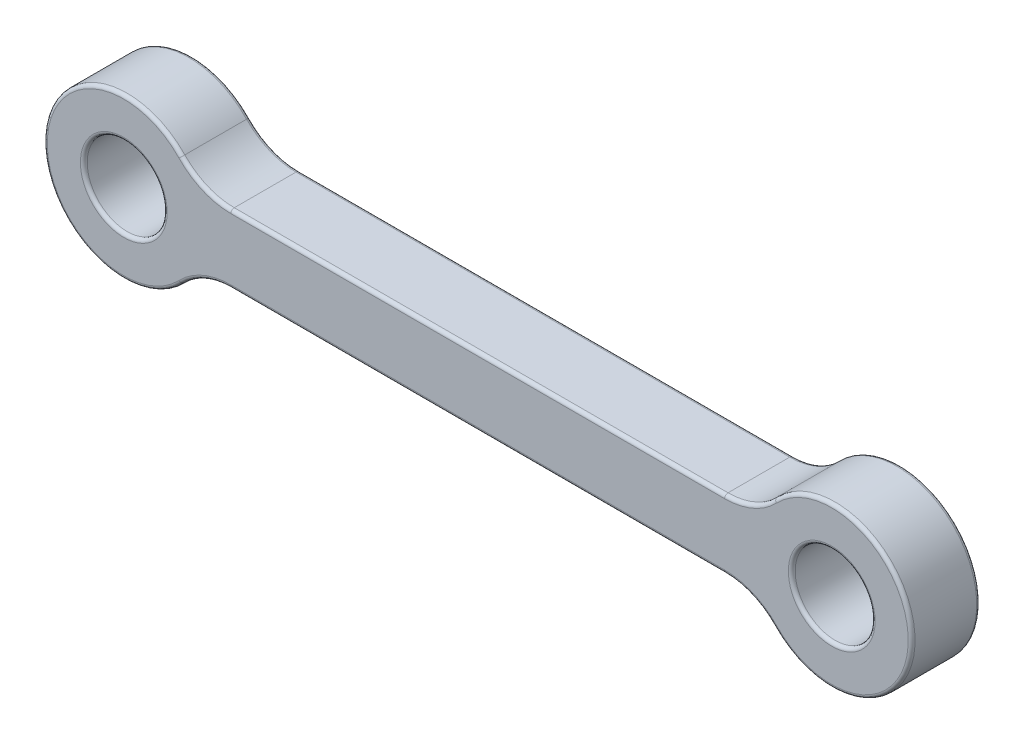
ISO-10303-21;
HEADER;
FILE_DESCRIPTION(('STEP AP214'),'2;1');
FILE_NAME('part.step','',(''),(''),'','','');
FILE_SCHEMA(('AUTOMOTIVE_DESIGN { 1 0 10303 214 1 1 1 1 }'));
ENDSEC;
DATA;
#1=APPLICATION_CONTEXT('core data for automotive mechanical design processes');
#2=APPLICATION_PROTOCOL_DEFINITION('international standard','automotive_design',2000,#1);
#3=PRODUCT_CONTEXT('',#1,'mechanical');
#4=PRODUCT('Part','Part','',(#3));
#5=PRODUCT_RELATED_PRODUCT_CATEGORY('part','',(#4));
#6=PRODUCT_DEFINITION_FORMATION('','',#4);
#7=PRODUCT_DEFINITION_CONTEXT('part definition',#1,'design');
#8=PRODUCT_DEFINITION('design','',#6,#7);
#9=PRODUCT_DEFINITION_SHAPE('','',#8);
#10=(LENGTH_UNIT() NAMED_UNIT(*) SI_UNIT(.MILLI.,.METRE.));
#11=(NAMED_UNIT(*) PLANE_ANGLE_UNIT() SI_UNIT($,.RADIAN.));
#12=(NAMED_UNIT(*) SI_UNIT($,.STERADIAN.) SOLID_ANGLE_UNIT());
#13=UNCERTAINTY_MEASURE_WITH_UNIT(LENGTH_MEASURE(1.E-05),#10,'distance_accuracy_value','');
#14=(GEOMETRIC_REPRESENTATION_CONTEXT(3) GLOBAL_UNCERTAINTY_ASSIGNED_CONTEXT((#13)) GLOBAL_UNIT_ASSIGNED_CONTEXT((#10,
#11,#12)) REPRESENTATION_CONTEXT('',''));
#15=CARTESIAN_POINT('',(0.,0.,0.));
#16=DIRECTION('',(0.,0.,1.));
#17=DIRECTION('',(1.,0.,0.));
#18=AXIS2_PLACEMENT_3D('',#15,#16,#17);
#19=CARTESIAN_POINT('',(0.,0.,1.5));
#20=DIRECTION('',(0.,0.,-1.));
#21=DIRECTION('',(-1.,0.,0.));
#22=AXIS2_PLACEMENT_3D('',#19,#20,#21);
#23=CYLINDRICAL_SURFACE('',#22,3.5);
#24=DIRECTION('',(0.,0.,-1.));
#25=VECTOR('',#24,1.);
#26=CARTESIAN_POINT('',(2.52560848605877,-2.42307692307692,1.5));
#27=LINE('',#26,#25);
#28=CARTESIAN_POINT('',(2.52560848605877,-2.42307692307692,-1.35));
#29=VERTEX_POINT('',#28);
#30=CARTESIAN_POINT('',(2.52560848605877,-2.42307692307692,1.35));
#31=VERTEX_POINT('',#30);
#32=EDGE_CURVE('E268',#29,#31,#27,.F.);
#33=ORIENTED_EDGE('',*,*,#32,.T.);
#34=CARTESIAN_POINT('',(0.,0.,1.35));
#35=DIRECTION('',(0.,0.,1.));
#36=DIRECTION('',(1.,0.,0.));
#37=AXIS2_PLACEMENT_3D('',#34,#35,#36);
#38=CIRCLE('',#37,3.5);
#39=CARTESIAN_POINT('',(2.52560848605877,2.42307692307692,1.35));
#40=VERTEX_POINT('',#39);
#41=EDGE_CURVE('E219',#31,#40,#38,.F.);
#42=ORIENTED_EDGE('',*,*,#41,.T.);
#43=DIRECTION('',(0.,0.,-1.));
#44=VECTOR('',#43,1.);
#45=CARTESIAN_POINT('',(2.52560848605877,2.42307692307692,1.5));
#46=LINE('',#45,#44);
#47=CARTESIAN_POINT('',(2.52560848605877,2.42307692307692,-1.35));
#48=VERTEX_POINT('',#47);
#49=EDGE_CURVE('E314',#40,#48,#46,.T.);
#50=ORIENTED_EDGE('',*,*,#49,.T.);
#51=CARTESIAN_POINT('',(0.,0.,-1.35));
#52=DIRECTION('',(0.,0.,1.));
#53=DIRECTION('',(1.,0.,0.));
#54=AXIS2_PLACEMENT_3D('',#51,#52,#53);
#55=CIRCLE('',#54,3.5);
#56=EDGE_CURVE('E217',#48,#29,#55,.T.);
#57=ORIENTED_EDGE('',*,*,#56,.T.);
#58=EDGE_LOOP('',(#33,#42,#50,#57));
#59=FACE_BOUND('',#58,.T.);
#60=ADVANCED_FACE('F41',(#59),#23,.T.);
#61=CARTESIAN_POINT('',(0.,-1.5,1.5));
#62=DIRECTION('',(0.,-1.,0.));
#63=DIRECTION('',(0.,0.,-1.));
#64=AXIS2_PLACEMENT_3D('',#61,#62,#63);
#65=PLANE('',#64);
#66=DIRECTION('',(0.,0.,1.));
#67=VECTOR('',#66,1.);
#68=CARTESIAN_POINT('',(26.3095842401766,-1.5,1.5));
#69=LINE('',#68,#67);
#70=CARTESIAN_POINT('',(26.3095842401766,-1.5,-1.35));
#71=VERTEX_POINT('',#70);
#72=CARTESIAN_POINT('',(26.3095842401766,-1.5,1.35));
#73=VERTEX_POINT('',#72);
#74=EDGE_CURVE('E325',#71,#73,#69,.T.);
#75=ORIENTED_EDGE('',*,*,#74,.T.);
#76=DIRECTION('',(-1.,0.,0.));
#77=VECTOR('',#76,1.);
#78=CARTESIAN_POINT('',(0.,-1.5,1.35));
#79=LINE('',#78,#77);
#80=CARTESIAN_POINT('',(4.69041575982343,-1.5,1.35));
#81=VERTEX_POINT('',#80);
#82=EDGE_CURVE('E210',#73,#81,#79,.T.);
#83=ORIENTED_EDGE('',*,*,#82,.T.);
#84=DIRECTION('',(0.,0.,-1.));
#85=VECTOR('',#84,1.);
#86=CARTESIAN_POINT('',(4.69041575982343,-1.5,1.5));
#87=LINE('',#86,#85);
#88=CARTESIAN_POINT('',(4.69041575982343,-1.5,-1.35));
#89=VERTEX_POINT('',#88);
#90=EDGE_CURVE('E328',#81,#89,#87,.T.);
#91=ORIENTED_EDGE('',*,*,#90,.T.);
#92=DIRECTION('',(-1.,0.,0.));
#93=VECTOR('',#92,1.);
#94=CARTESIAN_POINT('',(26.3095842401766,-1.5,-1.35));
#95=LINE('',#94,#93);
#96=EDGE_CURVE('E208',#89,#71,#95,.F.);
#97=ORIENTED_EDGE('',*,*,#96,.T.);
#98=EDGE_LOOP('',(#75,#83,#91,#97));
#99=FACE_BOUND('',#98,.T.);
#100=ADVANCED_FACE('F396',(#99),#65,.T.);
#101=CARTESIAN_POINT('',(31.,0.,1.5));
#102=DIRECTION('',(0.,0.,-1.));
#103=DIRECTION('',(-1.,0.,0.));
#104=AXIS2_PLACEMENT_3D('',#101,#102,#103);
#105=CYLINDRICAL_SURFACE('',#104,3.5);
#106=DIRECTION('',(0.,0.,-1.));
#107=VECTOR('',#106,1.);
#108=CARTESIAN_POINT('',(28.4743915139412,2.42307692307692,1.5));
#109=LINE('',#108,#107);
#110=CARTESIAN_POINT('',(28.4743915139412,2.42307692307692,-1.35));
#111=VERTEX_POINT('',#110);
#112=CARTESIAN_POINT('',(28.4743915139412,2.42307692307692,1.35));
#113=VERTEX_POINT('',#112);
#114=EDGE_CURVE('E308',#111,#113,#109,.F.);
#115=ORIENTED_EDGE('',*,*,#114,.T.);
#116=CARTESIAN_POINT('',(31.,0.,1.35));
#117=DIRECTION('',(0.,0.,1.));
#118=DIRECTION('',(1.,0.,0.));
#119=AXIS2_PLACEMENT_3D('',#116,#117,#118);
#120=CIRCLE('',#119,3.5);
#121=CARTESIAN_POINT('',(28.4743915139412,-2.42307692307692,1.35));
#122=VERTEX_POINT('',#121);
#123=EDGE_CURVE('E202',#113,#122,#120,.F.);
#124=ORIENTED_EDGE('',*,*,#123,.T.);
#125=DIRECTION('',(0.,0.,-1.));
#126=VECTOR('',#125,1.);
#127=CARTESIAN_POINT('',(28.4743915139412,-2.42307692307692,1.5));
#128=LINE('',#127,#126);
#129=CARTESIAN_POINT('',(28.4743915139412,-2.42307692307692,-1.35));
#130=VERTEX_POINT('',#129);
#131=EDGE_CURVE('E316',#122,#130,#128,.T.);
#132=ORIENTED_EDGE('',*,*,#131,.T.);
#133=CARTESIAN_POINT('',(31.,0.,-1.35));
#134=DIRECTION('',(0.,0.,1.));
#135=DIRECTION('',(1.,0.,0.));
#136=AXIS2_PLACEMENT_3D('',#133,#134,#135);
#137=CIRCLE('',#136,3.5);
#138=EDGE_CURVE('E200',#130,#111,#137,.T.);
#139=ORIENTED_EDGE('',*,*,#138,.T.);
#140=EDGE_LOOP('',(#115,#124,#132,#139));
#141=FACE_BOUND('',#140,.T.);
#142=ADVANCED_FACE('F351',(#141),#105,.T.);
#143=CARTESIAN_POINT('',(0.,1.5,1.5));
#144=DIRECTION('',(0.,-1.,0.));
#145=DIRECTION('',(0.,0.,-1.));
#146=AXIS2_PLACEMENT_3D('',#143,#144,#145);
#147=PLANE('',#146);
#148=DIRECTION('',(0.,0.,1.));
#149=VECTOR('',#148,1.);
#150=CARTESIAN_POINT('',(4.69041575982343,1.5,1.5));
#151=LINE('',#150,#149);
#152=CARTESIAN_POINT('',(4.69041575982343,1.5,-1.35));
#153=VERTEX_POINT('',#152);
#154=CARTESIAN_POINT('',(4.69041575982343,1.5,1.35));
#155=VERTEX_POINT('',#154);
#156=EDGE_CURVE('E313',#153,#155,#151,.T.);
#157=ORIENTED_EDGE('',*,*,#156,.T.);
#158=DIRECTION('',(-1.,0.,0.));
#159=VECTOR('',#158,1.);
#160=CARTESIAN_POINT('',(26.3095842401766,1.5,1.35));
#161=LINE('',#160,#159);
#162=CARTESIAN_POINT('',(26.3095842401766,1.5,1.35));
#163=VERTEX_POINT('',#162);
#164=EDGE_CURVE('E227',#155,#163,#161,.F.);
#165=ORIENTED_EDGE('',*,*,#164,.T.);
#166=DIRECTION('',(0.,0.,-1.));
#167=VECTOR('',#166,1.);
#168=CARTESIAN_POINT('',(26.3095842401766,1.5,1.5));
#169=LINE('',#168,#167);
#170=CARTESIAN_POINT('',(26.3095842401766,1.5,-1.35));
#171=VERTEX_POINT('',#170);
#172=EDGE_CURVE('E306',#163,#171,#169,.T.);
#173=ORIENTED_EDGE('',*,*,#172,.T.);
#174=DIRECTION('',(-1.,0.,0.));
#175=VECTOR('',#174,1.);
#176=CARTESIAN_POINT('',(0.,1.5,-1.35));
#177=LINE('',#176,#175);
#178=EDGE_CURVE('E225',#171,#153,#177,.T.);
#179=ORIENTED_EDGE('',*,*,#178,.T.);
#180=EDGE_LOOP('',(#157,#165,#173,#179));
#181=FACE_BOUND('',#180,.T.);
#182=ADVANCED_FACE('F311',(#181),#147,.F.);
#183=CARTESIAN_POINT('',(0.,0.,1.5));
#184=DIRECTION('',(0.,0.,-1.));
#185=DIRECTION('',(-1.,0.,0.));
#186=AXIS2_PLACEMENT_3D('',#183,#184,#185);
#187=CYLINDRICAL_SURFACE('',#186,1.75);
#188=CARTESIAN_POINT('',(0.,0.,1.35));
#189=DIRECTION('',(0.,0.,1.));
#190=DIRECTION('',(1.,0.,0.));
#191=AXIS2_PLACEMENT_3D('',#188,#189,#190);
#192=CIRCLE('',#191,1.75);
#193=CARTESIAN_POINT('',(1.75,0.,1.35));
#194=VERTEX_POINT('',#193);
#195=EDGE_CURVE('E232',#194,#194,#192,.T.);
#196=ORIENTED_EDGE('',*,*,#195,.T.);
#197=EDGE_LOOP('',(#196));
#198=FACE_BOUND('',#197,.T.);
#199=CARTESIAN_POINT('',(0.,0.,-1.35));
#200=DIRECTION('',(0.,0.,1.));
#201=DIRECTION('',(1.,0.,0.));
#202=AXIS2_PLACEMENT_3D('',#199,#200,#201);
#203=CIRCLE('',#202,1.75);
#204=CARTESIAN_POINT('',(1.75,0.,-1.35));
#205=VERTEX_POINT('',#204);
#206=EDGE_CURVE('E229',#205,#205,#203,.F.);
#207=ORIENTED_EDGE('',*,*,#206,.T.);
#208=EDGE_LOOP('',(#207));
#209=FACE_BOUND('',#208,.T.);
#210=ADVANCED_FACE('F407',(#198,#209),#187,.F.);
#211=CARTESIAN_POINT('',(31.,0.,1.5));
#212=DIRECTION('',(0.,0.,-1.));
#213=DIRECTION('',(-1.,0.,0.));
#214=AXIS2_PLACEMENT_3D('',#211,#212,#213);
#215=CYLINDRICAL_SURFACE('',#214,1.75);
#216=CARTESIAN_POINT('',(31.,0.,1.35));
#217=DIRECTION('',(0.,0.,1.));
#218=DIRECTION('',(1.,0.,0.));
#219=AXIS2_PLACEMENT_3D('',#216,#217,#218);
#220=CIRCLE('',#219,1.75);
#221=CARTESIAN_POINT('',(32.75,0.,1.35));
#222=VERTEX_POINT('',#221);
#223=EDGE_CURVE('E194',#222,#222,#220,.T.);
#224=ORIENTED_EDGE('',*,*,#223,.T.);
#225=EDGE_LOOP('',(#224));
#226=FACE_BOUND('',#225,.T.);
#227=CARTESIAN_POINT('',(31.,0.,-1.35));
#228=DIRECTION('',(0.,0.,1.));
#229=DIRECTION('',(1.,0.,0.));
#230=AXIS2_PLACEMENT_3D('',#227,#228,#229);
#231=CIRCLE('',#230,1.75);
#232=CARTESIAN_POINT('',(32.75,0.,-1.35));
#233=VERTEX_POINT('',#232);
#234=EDGE_CURVE('E186',#233,#233,#231,.F.);
#235=ORIENTED_EDGE('',*,*,#234,.T.);
#236=EDGE_LOOP('',(#235));
#237=FACE_BOUND('',#236,.T.);
#238=ADVANCED_FACE('F410',(#226,#237),#215,.F.);
#239=CARTESIAN_POINT('',(0.,0.,1.5));
#240=DIRECTION('',(0.,0.,1.));
#241=DIRECTION('',(1.,0.,0.));
#242=AXIS2_PLACEMENT_3D('',#239,#240,#241);
#243=PLANE('',#242);
#244=CARTESIAN_POINT('',(31.,0.,1.5));
#245=DIRECTION('',(0.,0.,1.));
#246=DIRECTION('',(1.,0.,0.));
#247=AXIS2_PLACEMENT_3D('',#244,#245,#246);
#248=CIRCLE('',#247,1.9);
#249=CARTESIAN_POINT('',(32.9,0.,1.5));
#250=VERTEX_POINT('',#249);
#251=EDGE_CURVE('E183',#250,#250,#248,.F.);
#252=ORIENTED_EDGE('',*,*,#251,.T.);
#253=EDGE_LOOP('',(#252));
#254=FACE_BOUND('',#253,.T.);
#255=CARTESIAN_POINT('',(31.,0.,1.5));
#256=DIRECTION('',(0.,0.,1.));
#257=DIRECTION('',(1.,0.,0.));
#258=AXIS2_PLACEMENT_3D('',#255,#256,#257);
#259=CIRCLE('',#258,3.35);
#260=CARTESIAN_POINT('',(28.5826318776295,-2.31923076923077,1.5));
#261=VERTEX_POINT('',#260);
#262=CARTESIAN_POINT('',(28.5826318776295,2.31923076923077,1.5));
#263=VERTEX_POINT('',#262);
#264=EDGE_CURVE('E181',#261,#263,#259,.T.);
#265=ORIENTED_EDGE('',*,*,#264,.T.);
#266=CARTESIAN_POINT('',(26.3095842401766,4.5,1.5));
#267=DIRECTION('',(0.,0.,1.));
#268=DIRECTION('',(1.,0.,0.));
#269=AXIS2_PLACEMENT_3D('',#266,#267,#268);
#270=CIRCLE('',#269,3.15);
#271=CARTESIAN_POINT('',(26.3095842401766,1.35,1.5));
#272=VERTEX_POINT('',#271);
#273=EDGE_CURVE('E161',#263,#272,#270,.F.);
#274=ORIENTED_EDGE('',*,*,#273,.T.);
#275=DIRECTION('',(-1.,0.,0.));
#276=VECTOR('',#275,1.);
#277=CARTESIAN_POINT('',(4.69041575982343,1.35,1.5));
#278=LINE('',#277,#276);
#279=CARTESIAN_POINT('',(4.69041575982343,1.35,1.5));
#280=VERTEX_POINT('',#279);
#281=EDGE_CURVE('E169',#272,#280,#278,.T.);
#282=ORIENTED_EDGE('',*,*,#281,.T.);
#283=CARTESIAN_POINT('',(4.69041575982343,4.5,1.5));
#284=DIRECTION('',(0.,0.,1.));
#285=DIRECTION('',(1.,0.,0.));
#286=AXIS2_PLACEMENT_3D('',#283,#284,#285);
#287=CIRCLE('',#286,3.15);
#288=CARTESIAN_POINT('',(2.41736812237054,2.31923076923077,1.5));
#289=VERTEX_POINT('',#288);
#290=EDGE_CURVE('E175',#280,#289,#287,.F.);
#291=ORIENTED_EDGE('',*,*,#290,.T.);
#292=CARTESIAN_POINT('',(0.,0.,1.5));
#293=DIRECTION('',(0.,0.,1.));
#294=DIRECTION('',(1.,0.,0.));
#295=AXIS2_PLACEMENT_3D('',#292,#293,#294);
#296=CIRCLE('',#295,3.35);
#297=CARTESIAN_POINT('',(2.41736812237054,-2.31923076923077,1.5));
#298=VERTEX_POINT('',#297);
#299=EDGE_CURVE('E334',#289,#298,#296,.T.);
#300=ORIENTED_EDGE('',*,*,#299,.T.);
#301=CARTESIAN_POINT('',(4.69041575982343,-4.5,1.5));
#302=DIRECTION('',(0.,0.,1.));
#303=DIRECTION('',(1.,0.,0.));
#304=AXIS2_PLACEMENT_3D('',#301,#302,#303);
#305=CIRCLE('',#304,3.15);
#306=CARTESIAN_POINT('',(4.69041575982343,-1.35,1.5));
#307=VERTEX_POINT('',#306);
#308=EDGE_CURVE('E336',#298,#307,#305,.F.);
#309=ORIENTED_EDGE('',*,*,#308,.T.);
#310=DIRECTION('',(-1.,0.,0.));
#311=VECTOR('',#310,1.);
#312=CARTESIAN_POINT('',(0.,-1.35,1.5));
#313=LINE('',#312,#311);
#314=CARTESIAN_POINT('',(26.3095842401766,-1.35,1.5));
#315=VERTEX_POINT('',#314);
#316=EDGE_CURVE('E338',#307,#315,#313,.F.);
#317=ORIENTED_EDGE('',*,*,#316,.T.);
#318=CARTESIAN_POINT('',(26.3095842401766,-4.5,1.5));
#319=DIRECTION('',(0.,0.,1.));
#320=DIRECTION('',(1.,0.,0.));
#321=AXIS2_PLACEMENT_3D('',#318,#319,#320);
#322=CIRCLE('',#321,3.15);
#323=EDGE_CURVE('E188',#315,#261,#322,.F.);
#324=ORIENTED_EDGE('',*,*,#323,.T.);
#325=EDGE_LOOP('',(#265,#274,#282,#291,#300,#309,#317,#324));
#326=FACE_BOUND('',#325,.T.);
#327=CARTESIAN_POINT('',(0.,0.,1.5));
#328=DIRECTION('',(0.,0.,1.));
#329=DIRECTION('',(1.,0.,0.));
#330=AXIS2_PLACEMENT_3D('',#327,#328,#329);
#331=CIRCLE('',#330,1.9);
#332=CARTESIAN_POINT('',(1.9,0.,1.5));
#333=VERTEX_POINT('',#332);
#334=EDGE_CURVE('E176',#333,#333,#331,.F.);
#335=ORIENTED_EDGE('',*,*,#334,.T.);
#336=EDGE_LOOP('',(#335));
#337=FACE_BOUND('',#336,.T.);
#338=ADVANCED_FACE('F178',(#254,#326,#337),#243,.T.);
#339=CARTESIAN_POINT('',(0.,0.,-1.5));
#340=DIRECTION('',(0.,0.,1.));
#341=DIRECTION('',(1.,0.,0.));
#342=AXIS2_PLACEMENT_3D('',#339,#340,#341);
#343=PLANE('',#342);
#344=CARTESIAN_POINT('',(31.,0.,-1.5));
#345=DIRECTION('',(0.,0.,1.));
#346=DIRECTION('',(1.,0.,0.));
#347=AXIS2_PLACEMENT_3D('',#344,#345,#346);
#348=CIRCLE('',#347,1.9);
#349=CARTESIAN_POINT('',(32.9,0.,-1.5));
#350=VERTEX_POINT('',#349);
#351=EDGE_CURVE('E11',#350,#350,#348,.T.);
#352=ORIENTED_EDGE('',*,*,#351,.T.);
#353=EDGE_LOOP('',(#352));
#354=FACE_BOUND('',#353,.T.);
#355=DIRECTION('',(-1.,0.,0.));
#356=VECTOR('',#355,1.);
#357=CARTESIAN_POINT('',(4.69041575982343,-1.35,-1.5));
#358=LINE('',#357,#356);
#359=CARTESIAN_POINT('',(26.3095842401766,-1.35,-1.5));
#360=VERTEX_POINT('',#359);
#361=CARTESIAN_POINT('',(4.69041575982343,-1.35,-1.5));
#362=VERTEX_POINT('',#361);
#363=EDGE_CURVE('E58',#360,#362,#358,.T.);
#364=ORIENTED_EDGE('',*,*,#363,.T.);
#365=CARTESIAN_POINT('',(4.69041575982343,-4.5,-1.5));
#366=DIRECTION('',(0.,0.,1.));
#367=DIRECTION('',(1.,0.,0.));
#368=AXIS2_PLACEMENT_3D('',#365,#366,#367);
#369=CIRCLE('',#368,3.15);
#370=CARTESIAN_POINT('',(2.41736812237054,-2.31923076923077,-1.5));
#371=VERTEX_POINT('',#370);
#372=EDGE_CURVE('E50',#362,#371,#369,.T.);
#373=ORIENTED_EDGE('',*,*,#372,.T.);
#374=CARTESIAN_POINT('',(0.,0.,-1.5));
#375=DIRECTION('',(0.,0.,1.));
#376=DIRECTION('',(1.,0.,0.));
#377=AXIS2_PLACEMENT_3D('',#374,#375,#376);
#378=CIRCLE('',#377,3.35);
#379=CARTESIAN_POINT('',(2.41736812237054,2.31923076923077,-1.5));
#380=VERTEX_POINT('',#379);
#381=EDGE_CURVE('E238',#371,#380,#378,.F.);
#382=ORIENTED_EDGE('',*,*,#381,.T.);
#383=CARTESIAN_POINT('',(4.69041575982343,4.5,-1.5));
#384=DIRECTION('',(0.,0.,1.));
#385=DIRECTION('',(1.,0.,0.));
#386=AXIS2_PLACEMENT_3D('',#383,#384,#385);
#387=CIRCLE('',#386,3.15);
#388=CARTESIAN_POINT('',(4.69041575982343,1.35,-1.5));
#389=VERTEX_POINT('',#388);
#390=EDGE_CURVE('E240',#380,#389,#387,.T.);
#391=ORIENTED_EDGE('',*,*,#390,.T.);
#392=DIRECTION('',(-1.,0.,0.));
#393=VECTOR('',#392,1.);
#394=CARTESIAN_POINT('',(0.,1.35,-1.5));
#395=LINE('',#394,#393);
#396=CARTESIAN_POINT('',(26.3095842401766,1.35,-1.5));
#397=VERTEX_POINT('',#396);
#398=EDGE_CURVE('E242',#389,#397,#395,.F.);
#399=ORIENTED_EDGE('',*,*,#398,.T.);
#400=CARTESIAN_POINT('',(26.3095842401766,4.5,-1.5));
#401=DIRECTION('',(0.,0.,1.));
#402=DIRECTION('',(1.,0.,0.));
#403=AXIS2_PLACEMENT_3D('',#400,#401,#402);
#404=CIRCLE('',#403,3.15);
#405=CARTESIAN_POINT('',(28.5826318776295,2.31923076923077,-1.5));
#406=VERTEX_POINT('',#405);
#407=EDGE_CURVE('E244',#397,#406,#404,.T.);
#408=ORIENTED_EDGE('',*,*,#407,.T.);
#409=CARTESIAN_POINT('',(31.,0.,-1.5));
#410=DIRECTION('',(0.,0.,1.));
#411=DIRECTION('',(1.,0.,0.));
#412=AXIS2_PLACEMENT_3D('',#409,#410,#411);
#413=CIRCLE('',#412,3.35);
#414=CARTESIAN_POINT('',(28.5826318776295,-2.31923076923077,-1.5));
#415=VERTEX_POINT('',#414);
#416=EDGE_CURVE('E246',#406,#415,#413,.F.);
#417=ORIENTED_EDGE('',*,*,#416,.T.);
#418=CARTESIAN_POINT('',(26.3095842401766,-4.5,-1.5));
#419=DIRECTION('',(0.,0.,1.));
#420=DIRECTION('',(1.,0.,0.));
#421=AXIS2_PLACEMENT_3D('',#418,#419,#420);
#422=CIRCLE('',#421,3.15);
#423=EDGE_CURVE('E63',#415,#360,#422,.T.);
#424=ORIENTED_EDGE('',*,*,#423,.T.);
#425=EDGE_LOOP('',(#364,#373,#382,#391,#399,#408,#417,#424));
#426=FACE_BOUND('',#425,.T.);
#427=CARTESIAN_POINT('',(0.,0.,-1.5));
#428=DIRECTION('',(0.,0.,1.));
#429=DIRECTION('',(1.,0.,0.));
#430=AXIS2_PLACEMENT_3D('',#427,#428,#429);
#431=CIRCLE('',#430,1.9);
#432=CARTESIAN_POINT('',(1.9,0.,-1.5));
#433=VERTEX_POINT('',#432);
#434=EDGE_CURVE('E235',#433,#433,#431,.T.);
#435=ORIENTED_EDGE('',*,*,#434,.T.);
#436=EDGE_LOOP('',(#435));
#437=FACE_BOUND('',#436,.T.);
#438=ADVANCED_FACE('F367',(#354,#426,#437),#343,.F.);
#439=CARTESIAN_POINT('',(4.69041575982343,4.5,1.5));
#440=DIRECTION('',(0.,0.,-1.));
#441=DIRECTION('',(-1.,0.,0.));
#442=AXIS2_PLACEMENT_3D('',#439,#440,#441);
#443=CYLINDRICAL_SURFACE('',#442,3.);
#444=ORIENTED_EDGE('',*,*,#49,.F.);
#445=CARTESIAN_POINT('',(4.69041575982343,4.5,1.35));
#446=DIRECTION('',(0.,0.,1.));
#447=DIRECTION('',(1.,0.,0.));
#448=AXIS2_PLACEMENT_3D('',#445,#446,#447);
#449=CIRCLE('',#448,3.);
#450=EDGE_CURVE('E223',#40,#155,#449,.T.);
#451=ORIENTED_EDGE('',*,*,#450,.T.);
#452=ORIENTED_EDGE('',*,*,#156,.F.);
#453=CARTESIAN_POINT('',(4.69041575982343,4.5,-1.35));
#454=DIRECTION('',(0.,0.,1.));
#455=DIRECTION('',(1.,0.,0.));
#456=AXIS2_PLACEMENT_3D('',#453,#454,#455);
#457=CIRCLE('',#456,3.);
#458=EDGE_CURVE('E221',#153,#48,#457,.F.);
#459=ORIENTED_EDGE('',*,*,#458,.T.);
#460=EDGE_LOOP('',(#444,#451,#452,#459));
#461=FACE_BOUND('',#460,.T.);
#462=ADVANCED_FACE('F412',(#461),#443,.F.);
#463=CARTESIAN_POINT('',(26.3095842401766,4.5,1.5));
#464=DIRECTION('',(0.,0.,-1.));
#465=DIRECTION('',(-1.,0.,0.));
#466=AXIS2_PLACEMENT_3D('',#463,#464,#465);
#467=CYLINDRICAL_SURFACE('',#466,3.);
#468=ORIENTED_EDGE('',*,*,#172,.F.);
#469=CARTESIAN_POINT('',(26.3095842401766,4.5,1.35));
#470=DIRECTION('',(0.,0.,1.));
#471=DIRECTION('',(1.,0.,0.));
#472=AXIS2_PLACEMENT_3D('',#469,#470,#471);
#473=CIRCLE('',#472,3.);
#474=EDGE_CURVE('E163',#163,#113,#473,.T.);
#475=ORIENTED_EDGE('',*,*,#474,.T.);
#476=ORIENTED_EDGE('',*,*,#114,.F.);
#477=CARTESIAN_POINT('',(26.3095842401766,4.5,-1.35));
#478=DIRECTION('',(0.,0.,1.));
#479=DIRECTION('',(1.,0.,0.));
#480=AXIS2_PLACEMENT_3D('',#477,#478,#479);
#481=CIRCLE('',#480,3.);
#482=EDGE_CURVE('E197',#111,#171,#481,.F.);
#483=ORIENTED_EDGE('',*,*,#482,.T.);
#484=EDGE_LOOP('',(#468,#475,#476,#483));
#485=FACE_BOUND('',#484,.T.);
#486=ADVANCED_FACE('F305',(#485),#467,.F.);
#487=CARTESIAN_POINT('',(4.69041575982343,-4.5,1.5));
#488=DIRECTION('',(0.,0.,-1.));
#489=DIRECTION('',(-1.,0.,0.));
#490=AXIS2_PLACEMENT_3D('',#487,#488,#489);
#491=CYLINDRICAL_SURFACE('',#490,3.);
#492=ORIENTED_EDGE('',*,*,#90,.F.);
#493=CARTESIAN_POINT('',(4.69041575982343,-4.5,1.35));
#494=DIRECTION('',(0.,0.,1.));
#495=DIRECTION('',(1.,0.,0.));
#496=AXIS2_PLACEMENT_3D('',#493,#494,#495);
#497=CIRCLE('',#496,3.);
#498=EDGE_CURVE('E215',#81,#31,#497,.T.);
#499=ORIENTED_EDGE('',*,*,#498,.T.);
#500=ORIENTED_EDGE('',*,*,#32,.F.);
#501=CARTESIAN_POINT('',(4.69041575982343,-4.5,-1.35));
#502=DIRECTION('',(0.,0.,1.));
#503=DIRECTION('',(1.,0.,0.));
#504=AXIS2_PLACEMENT_3D('',#501,#502,#503);
#505=CIRCLE('',#504,3.);
#506=EDGE_CURVE('E212',#29,#89,#505,.F.);
#507=ORIENTED_EDGE('',*,*,#506,.T.);
#508=EDGE_LOOP('',(#492,#499,#500,#507));
#509=FACE_BOUND('',#508,.T.);
#510=ADVANCED_FACE('F385',(#509),#491,.F.);
#511=CARTESIAN_POINT('',(26.3095842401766,-4.5,1.5));
#512=DIRECTION('',(0.,0.,-1.));
#513=DIRECTION('',(-1.,0.,0.));
#514=AXIS2_PLACEMENT_3D('',#511,#512,#513);
#515=CYLINDRICAL_SURFACE('',#514,3.);
#516=ORIENTED_EDGE('',*,*,#131,.F.);
#517=CARTESIAN_POINT('',(26.3095842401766,-4.5,1.35));
#518=DIRECTION('',(0.,0.,1.));
#519=DIRECTION('',(1.,0.,0.));
#520=AXIS2_PLACEMENT_3D('',#517,#518,#519);
#521=CIRCLE('',#520,3.);
#522=EDGE_CURVE('E206',#122,#73,#521,.T.);
#523=ORIENTED_EDGE('',*,*,#522,.T.);
#524=ORIENTED_EDGE('',*,*,#74,.F.);
#525=CARTESIAN_POINT('',(26.3095842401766,-4.5,-1.35));
#526=DIRECTION('',(0.,0.,1.));
#527=DIRECTION('',(1.,0.,0.));
#528=AXIS2_PLACEMENT_3D('',#525,#526,#527);
#529=CIRCLE('',#528,3.);
#530=EDGE_CURVE('E204',#71,#130,#529,.F.);
#531=ORIENTED_EDGE('',*,*,#530,.T.);
#532=EDGE_LOOP('',(#516,#523,#524,#531));
#533=FACE_BOUND('',#532,.T.);
#534=ADVANCED_FACE('F353',(#533),#515,.F.);
#535=CARTESIAN_POINT('',(31.,0.,1.35));
#536=DIRECTION('',(0.,0.,1.));
#537=DIRECTION('',(1.,0.,0.));
#538=AXIS2_PLACEMENT_3D('',#535,#536,#537);
#539=TOROIDAL_SURFACE('',#538,1.9,0.15);
#540=ORIENTED_EDGE('',*,*,#223,.F.);
#541=EDGE_LOOP('',(#540));
#542=FACE_BOUND('',#541,.T.);
#543=ORIENTED_EDGE('',*,*,#251,.F.);
#544=EDGE_LOOP('',(#543));
#545=FACE_BOUND('',#544,.T.);
#546=ADVANCED_FACE('F422',(#542,#545),#539,.T.);
#547=CARTESIAN_POINT('',(4.69041575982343,-4.5,1.35));
#548=DIRECTION('',(0.,0.,1.));
#549=DIRECTION('',(1.,0.,0.));
#550=AXIS2_PLACEMENT_3D('',#547,#548,#549);
#551=TOROIDAL_SURFACE('',#550,3.15,0.15);
#552=CARTESIAN_POINT('',(2.41736812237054,-2.31923076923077,1.35));
#553=DIRECTION('',(-0.692307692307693,-0.72160242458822,0.));
#554=DIRECTION('',(0.72160242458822,-0.692307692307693,0.));
#555=AXIS2_PLACEMENT_3D('',#552,#553,#554);
#556=CIRCLE('',#555,0.15);
#557=EDGE_CURVE('E262',#31,#298,#556,.T.);
#558=ORIENTED_EDGE('',*,*,#557,.F.);
#559=ORIENTED_EDGE('',*,*,#498,.F.);
#560=CARTESIAN_POINT('',(4.69041575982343,-1.35,1.35));
#561=DIRECTION('',(1.,0.,0.));
#562=DIRECTION('',(0.,0.,-1.));
#563=AXIS2_PLACEMENT_3D('',#560,#561,#562);
#564=CIRCLE('',#563,0.15);
#565=EDGE_CURVE('E265',#307,#81,#564,.T.);
#566=ORIENTED_EDGE('',*,*,#565,.F.);
#567=ORIENTED_EDGE('',*,*,#308,.F.);
#568=EDGE_LOOP('',(#558,#559,#566,#567));
#569=FACE_BOUND('',#568,.T.);
#570=ADVANCED_FACE('F389',(#569),#551,.T.);
#571=CARTESIAN_POINT('',(0.,-1.35,1.35));
#572=DIRECTION('',(-1.,0.,0.));
#573=DIRECTION('',(0.,0.,1.));
#574=AXIS2_PLACEMENT_3D('',#571,#572,#573);
#575=CYLINDRICAL_SURFACE('',#574,0.15);
#576=ORIENTED_EDGE('',*,*,#565,.T.);
#577=ORIENTED_EDGE('',*,*,#82,.F.);
#578=CARTESIAN_POINT('',(26.3095842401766,-1.35,1.35));
#579=DIRECTION('',(1.,0.,0.));
#580=DIRECTION('',(0.,0.,-1.));
#581=AXIS2_PLACEMENT_3D('',#578,#579,#580);
#582=CIRCLE('',#581,0.15);
#583=EDGE_CURVE('E259',#315,#73,#582,.T.);
#584=ORIENTED_EDGE('',*,*,#583,.F.);
#585=ORIENTED_EDGE('',*,*,#316,.F.);
#586=EDGE_LOOP('',(#576,#577,#584,#585));
#587=FACE_BOUND('',#586,.T.);
#588=ADVANCED_FACE('F394',(#587),#575,.T.);
#589=CARTESIAN_POINT('',(0.,0.,1.35));
#590=DIRECTION('',(0.,0.,1.));
#591=DIRECTION('',(1.,0.,0.));
#592=AXIS2_PLACEMENT_3D('',#589,#590,#591);
#593=TOROIDAL_SURFACE('',#592,3.35,0.15);
#594=ORIENTED_EDGE('',*,*,#557,.T.);
#595=ORIENTED_EDGE('',*,*,#299,.F.);
#596=CARTESIAN_POINT('',(2.41736812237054,2.31923076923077,1.35));
#597=DIRECTION('',(0.692307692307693,-0.72160242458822,0.));
#598=DIRECTION('',(0.72160242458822,0.692307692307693,0.));
#599=AXIS2_PLACEMENT_3D('',#596,#597,#598);
#600=CIRCLE('',#599,0.15);
#601=EDGE_CURVE('E256',#40,#289,#600,.T.);
#602=ORIENTED_EDGE('',*,*,#601,.F.);
#603=ORIENTED_EDGE('',*,*,#41,.F.);
#604=EDGE_LOOP('',(#594,#595,#602,#603));
#605=FACE_BOUND('',#604,.T.);
#606=ADVANCED_FACE('F439',(#605),#593,.T.);
#607=CARTESIAN_POINT('',(26.3095842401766,-4.5,1.35));
#608=DIRECTION('',(0.,0.,1.));
#609=DIRECTION('',(1.,0.,0.));
#610=AXIS2_PLACEMENT_3D('',#607,#608,#609);
#611=TOROIDAL_SURFACE('',#610,3.15,0.15);
#612=ORIENTED_EDGE('',*,*,#583,.T.);
#613=ORIENTED_EDGE('',*,*,#522,.F.);
#614=CARTESIAN_POINT('',(28.5826318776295,-2.31923076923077,1.35));
#615=DIRECTION('',(0.692307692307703,-0.72160242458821,0.));
#616=DIRECTION('',(0.72160242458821,0.692307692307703,0.));
#617=AXIS2_PLACEMENT_3D('',#614,#615,#616);
#618=CIRCLE('',#617,0.15);
#619=EDGE_CURVE('E253',#261,#122,#618,.T.);
#620=ORIENTED_EDGE('',*,*,#619,.F.);
#621=ORIENTED_EDGE('',*,*,#323,.F.);
#622=EDGE_LOOP('',(#612,#613,#620,#621));
#623=FACE_BOUND('',#622,.T.);
#624=ADVANCED_FACE('F345',(#623),#611,.T.);
#625=CARTESIAN_POINT('',(4.69041575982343,4.5,1.35));
#626=DIRECTION('',(0.,0.,1.));
#627=DIRECTION('',(1.,0.,0.));
#628=AXIS2_PLACEMENT_3D('',#625,#626,#627);
#629=TOROIDAL_SURFACE('',#628,3.15,0.15);
#630=ORIENTED_EDGE('',*,*,#601,.T.);
#631=ORIENTED_EDGE('',*,*,#290,.F.);
#632=CARTESIAN_POINT('',(4.69041575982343,1.35,1.35));
#633=DIRECTION('',(1.,0.,0.));
#634=DIRECTION('',(0.,0.,-1.));
#635=AXIS2_PLACEMENT_3D('',#632,#633,#634);
#636=CIRCLE('',#635,0.15);
#637=EDGE_CURVE('E172',#155,#280,#636,.T.);
#638=ORIENTED_EDGE('',*,*,#637,.F.);
#639=ORIENTED_EDGE('',*,*,#450,.F.);
#640=EDGE_LOOP('',(#630,#631,#638,#639));
#641=FACE_BOUND('',#640,.T.);
#642=ADVANCED_FACE('F433',(#641),#629,.T.);
#643=CARTESIAN_POINT('',(31.,0.,1.35));
#644=DIRECTION('',(0.,0.,1.));
#645=DIRECTION('',(1.,0.,0.));
#646=AXIS2_PLACEMENT_3D('',#643,#644,#645);
#647=TOROIDAL_SURFACE('',#646,3.35,0.15);
#648=ORIENTED_EDGE('',*,*,#619,.T.);
#649=ORIENTED_EDGE('',*,*,#123,.F.);
#650=CARTESIAN_POINT('',(28.5826318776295,2.31923076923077,1.35));
#651=DIRECTION('',(-0.692307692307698,-0.721602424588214,0.));
#652=DIRECTION('',(0.721602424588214,-0.692307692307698,0.));
#653=AXIS2_PLACEMENT_3D('',#650,#651,#652);
#654=CIRCLE('',#653,0.15);
#655=EDGE_CURVE('E166',#263,#113,#654,.T.);
#656=ORIENTED_EDGE('',*,*,#655,.F.);
#657=ORIENTED_EDGE('',*,*,#264,.F.);
#658=EDGE_LOOP('',(#648,#649,#656,#657));
#659=FACE_BOUND('',#658,.T.);
#660=ADVANCED_FACE('F348',(#659),#647,.T.);
#661=CARTESIAN_POINT('',(0.,1.35,1.35));
#662=DIRECTION('',(1.,0.,0.));
#663=DIRECTION('',(0.,0.,-1.));
#664=AXIS2_PLACEMENT_3D('',#661,#662,#663);
#665=CYLINDRICAL_SURFACE('',#664,0.15);
#666=ORIENTED_EDGE('',*,*,#637,.T.);
#667=ORIENTED_EDGE('',*,*,#281,.F.);
#668=CARTESIAN_POINT('',(26.3095842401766,1.35,1.35));
#669=DIRECTION('',(1.,0.,0.));
#670=DIRECTION('',(0.,0.,-1.));
#671=AXIS2_PLACEMENT_3D('',#668,#669,#670);
#672=CIRCLE('',#671,0.15);
#673=EDGE_CURVE('E157',#163,#272,#672,.T.);
#674=ORIENTED_EDGE('',*,*,#673,.F.);
#675=ORIENTED_EDGE('',*,*,#164,.F.);
#676=EDGE_LOOP('',(#666,#667,#674,#675));
#677=FACE_BOUND('',#676,.T.);
#678=ADVANCED_FACE('F170',(#677),#665,.T.);
#679=CARTESIAN_POINT('',(26.3095842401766,4.5,1.35));
#680=DIRECTION('',(0.,0.,1.));
#681=DIRECTION('',(1.,0.,0.));
#682=AXIS2_PLACEMENT_3D('',#679,#680,#681);
#683=TOROIDAL_SURFACE('',#682,3.15,0.15);
#684=ORIENTED_EDGE('',*,*,#655,.T.);
#685=ORIENTED_EDGE('',*,*,#474,.F.);
#686=ORIENTED_EDGE('',*,*,#673,.T.);
#687=ORIENTED_EDGE('',*,*,#273,.F.);
#688=EDGE_LOOP('',(#684,#685,#686,#687));
#689=FACE_BOUND('',#688,.T.);
#690=ADVANCED_FACE('F159',(#689),#683,.T.);
#691=CARTESIAN_POINT('',(0.,0.,1.35));
#692=DIRECTION('',(0.,0.,1.));
#693=DIRECTION('',(1.,0.,0.));
#694=AXIS2_PLACEMENT_3D('',#691,#692,#693);
#695=TOROIDAL_SURFACE('',#694,1.9,0.15);
#696=ORIENTED_EDGE('',*,*,#334,.F.);
#697=EDGE_LOOP('',(#696));
#698=FACE_BOUND('',#697,.T.);
#699=ORIENTED_EDGE('',*,*,#195,.F.);
#700=EDGE_LOOP('',(#699));
#701=FACE_BOUND('',#700,.T.);
#702=ADVANCED_FACE('F428',(#698,#701),#695,.T.);
#703=CARTESIAN_POINT('',(31.,0.,-1.35));
#704=DIRECTION('',(0.,0.,1.));
#705=DIRECTION('',(1.,0.,0.));
#706=AXIS2_PLACEMENT_3D('',#703,#704,#705);
#707=TOROIDAL_SURFACE('',#706,1.9,0.15);
#708=ORIENTED_EDGE('',*,*,#351,.F.);
#709=EDGE_LOOP('',(#708));
#710=FACE_BOUND('',#709,.T.);
#711=ORIENTED_EDGE('',*,*,#234,.F.);
#712=EDGE_LOOP('',(#711));
#713=FACE_BOUND('',#712,.T.);
#714=ADVANCED_FACE('F449',(#710,#713),#707,.T.);
#715=CARTESIAN_POINT('',(26.3095842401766,4.5,-1.35));
#716=DIRECTION('',(0.,0.,1.));
#717=DIRECTION('',(1.,0.,0.));
#718=AXIS2_PLACEMENT_3D('',#715,#716,#717);
#719=TOROIDAL_SURFACE('',#718,3.15,0.15);
#720=CARTESIAN_POINT('',(26.3095842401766,1.35,-1.35));
#721=DIRECTION('',(-1.,0.,0.));
#722=DIRECTION('',(0.,0.,1.));
#723=AXIS2_PLACEMENT_3D('',#720,#721,#722);
#724=CIRCLE('',#723,0.15);
#725=EDGE_CURVE('E284',#171,#397,#724,.T.);
#726=ORIENTED_EDGE('',*,*,#725,.F.);
#727=ORIENTED_EDGE('',*,*,#482,.F.);
#728=CARTESIAN_POINT('',(28.5826318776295,2.31923076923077,-1.35));
#729=DIRECTION('',(0.692307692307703,0.72160242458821,0.));
#730=DIRECTION('',(-0.72160242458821,0.692307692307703,0.));
#731=AXIS2_PLACEMENT_3D('',#728,#729,#730);
#732=CIRCLE('',#731,0.15);
#733=EDGE_CURVE('E45',#406,#111,#732,.T.);
#734=ORIENTED_EDGE('',*,*,#733,.F.);
#735=ORIENTED_EDGE('',*,*,#407,.F.);
#736=EDGE_LOOP('',(#726,#727,#734,#735));
#737=FACE_BOUND('',#736,.T.);
#738=ADVANCED_FACE('F300',(#737),#719,.T.);
#739=CARTESIAN_POINT('',(31.,0.,-1.35));
#740=DIRECTION('',(0.,0.,1.));
#741=DIRECTION('',(1.,0.,0.));
#742=AXIS2_PLACEMENT_3D('',#739,#740,#741);
#743=TOROIDAL_SURFACE('',#742,3.35,0.15);
#744=ORIENTED_EDGE('',*,*,#733,.T.);
#745=ORIENTED_EDGE('',*,*,#138,.F.);
#746=CARTESIAN_POINT('',(28.5826318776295,-2.31923076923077,-1.35));
#747=DIRECTION('',(-0.692307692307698,0.721602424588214,0.));
#748=DIRECTION('',(-0.721602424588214,-0.692307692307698,0.));
#749=AXIS2_PLACEMENT_3D('',#746,#747,#748);
#750=CIRCLE('',#749,0.15);
#751=EDGE_CURVE('E282',#415,#130,#750,.T.);
#752=ORIENTED_EDGE('',*,*,#751,.F.);
#753=ORIENTED_EDGE('',*,*,#416,.F.);
#754=EDGE_LOOP('',(#744,#745,#752,#753));
#755=FACE_BOUND('',#754,.T.);
#756=ADVANCED_FACE('F295',(#755),#743,.T.);
#757=CARTESIAN_POINT('',(0.,1.35,-1.35));
#758=DIRECTION('',(-1.,0.,0.));
#759=DIRECTION('',(0.,0.,1.));
#760=AXIS2_PLACEMENT_3D('',#757,#758,#759);
#761=CYLINDRICAL_SURFACE('',#760,0.15);
#762=ORIENTED_EDGE('',*,*,#725,.T.);
#763=ORIENTED_EDGE('',*,*,#398,.F.);
#764=CARTESIAN_POINT('',(4.69041575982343,1.35,-1.35));
#765=DIRECTION('',(-1.,0.,0.));
#766=DIRECTION('',(0.,0.,1.));
#767=AXIS2_PLACEMENT_3D('',#764,#765,#766);
#768=CIRCLE('',#767,0.15);
#769=EDGE_CURVE('E279',#153,#389,#768,.T.);
#770=ORIENTED_EDGE('',*,*,#769,.F.);
#771=ORIENTED_EDGE('',*,*,#178,.F.);
#772=EDGE_LOOP('',(#762,#763,#770,#771));
#773=FACE_BOUND('',#772,.T.);
#774=ADVANCED_FACE('F464',(#773),#761,.T.);
#775=CARTESIAN_POINT('',(26.3095842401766,-4.5,-1.35));
#776=DIRECTION('',(0.,0.,1.));
#777=DIRECTION('',(1.,0.,0.));
#778=AXIS2_PLACEMENT_3D('',#775,#776,#777);
#779=TOROIDAL_SURFACE('',#778,3.15,0.15);
#780=ORIENTED_EDGE('',*,*,#751,.T.);
#781=ORIENTED_EDGE('',*,*,#530,.F.);
#782=CARTESIAN_POINT('',(26.3095842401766,-1.35,-1.35));
#783=DIRECTION('',(-1.,0.,0.));
#784=DIRECTION('',(0.,0.,1.));
#785=AXIS2_PLACEMENT_3D('',#782,#783,#784);
#786=CIRCLE('',#785,0.15);
#787=EDGE_CURVE('E276',#360,#71,#786,.T.);
#788=ORIENTED_EDGE('',*,*,#787,.F.);
#789=ORIENTED_EDGE('',*,*,#423,.F.);
#790=EDGE_LOOP('',(#780,#781,#788,#789));
#791=FACE_BOUND('',#790,.T.);
#792=ADVANCED_FACE('F357',(#791),#779,.T.);
#793=CARTESIAN_POINT('',(4.69041575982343,4.5,-1.35));
#794=DIRECTION('',(0.,0.,1.));
#795=DIRECTION('',(1.,0.,0.));
#796=AXIS2_PLACEMENT_3D('',#793,#794,#795);
#797=TOROIDAL_SURFACE('',#796,3.15,0.15);
#798=ORIENTED_EDGE('',*,*,#769,.T.);
#799=ORIENTED_EDGE('',*,*,#390,.F.);
#800=CARTESIAN_POINT('',(2.41736812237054,2.31923076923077,-1.35));
#801=DIRECTION('',(-0.692307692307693,0.72160242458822,0.));
#802=DIRECTION('',(-0.72160242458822,-0.692307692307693,0.));
#803=AXIS2_PLACEMENT_3D('',#800,#801,#802);
#804=CIRCLE('',#803,0.15);
#805=EDGE_CURVE('E273',#48,#380,#804,.T.);
#806=ORIENTED_EDGE('',*,*,#805,.F.);
#807=ORIENTED_EDGE('',*,*,#458,.F.);
#808=EDGE_LOOP('',(#798,#799,#806,#807));
#809=FACE_BOUND('',#808,.T.);
#810=ADVANCED_FACE('F373',(#809),#797,.T.);
#811=CARTESIAN_POINT('',(0.,-1.35,-1.35));
#812=DIRECTION('',(1.,0.,0.));
#813=DIRECTION('',(0.,0.,-1.));
#814=AXIS2_PLACEMENT_3D('',#811,#812,#813);
#815=CYLINDRICAL_SURFACE('',#814,0.15);
#816=ORIENTED_EDGE('',*,*,#787,.T.);
#817=ORIENTED_EDGE('',*,*,#96,.F.);
#818=CARTESIAN_POINT('',(4.69041575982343,-1.35,-1.35));
#819=DIRECTION('',(-1.,0.,0.));
#820=DIRECTION('',(0.,0.,1.));
#821=AXIS2_PLACEMENT_3D('',#818,#819,#820);
#822=CIRCLE('',#821,0.15);
#823=EDGE_CURVE('E271',#362,#89,#822,.T.);
#824=ORIENTED_EDGE('',*,*,#823,.F.);
#825=ORIENTED_EDGE('',*,*,#363,.F.);
#826=EDGE_LOOP('',(#816,#817,#824,#825));
#827=FACE_BOUND('',#826,.T.);
#828=ADVANCED_FACE('F360',(#827),#815,.T.);
#829=CARTESIAN_POINT('',(0.,0.,-1.35));
#830=DIRECTION('',(0.,0.,1.));
#831=DIRECTION('',(1.,0.,0.));
#832=AXIS2_PLACEMENT_3D('',#829,#830,#831);
#833=TOROIDAL_SURFACE('',#832,3.35,0.15);
#834=ORIENTED_EDGE('',*,*,#805,.T.);
#835=ORIENTED_EDGE('',*,*,#381,.F.);
#836=CARTESIAN_POINT('',(2.41736812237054,-2.31923076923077,-1.35));
#837=DIRECTION('',(0.692307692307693,0.72160242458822,0.));
#838=DIRECTION('',(-0.72160242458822,0.692307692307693,0.));
#839=AXIS2_PLACEMENT_3D('',#836,#837,#838);
#840=CIRCLE('',#839,0.15);
#841=EDGE_CURVE('E269',#29,#371,#840,.T.);
#842=ORIENTED_EDGE('',*,*,#841,.F.);
#843=ORIENTED_EDGE('',*,*,#56,.F.);
#844=EDGE_LOOP('',(#834,#835,#842,#843));
#845=FACE_BOUND('',#844,.T.);
#846=ADVANCED_FACE('F377',(#845),#833,.T.);
#847=CARTESIAN_POINT('',(4.69041575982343,-4.5,-1.35));
#848=DIRECTION('',(0.,0.,1.));
#849=DIRECTION('',(1.,0.,0.));
#850=AXIS2_PLACEMENT_3D('',#847,#848,#849);
#851=TOROIDAL_SURFACE('',#850,3.15,0.15);
#852=ORIENTED_EDGE('',*,*,#823,.T.);
#853=ORIENTED_EDGE('',*,*,#506,.F.);
#854=ORIENTED_EDGE('',*,*,#841,.T.);
#855=ORIENTED_EDGE('',*,*,#372,.F.);
#856=EDGE_LOOP('',(#852,#853,#854,#855));
#857=FACE_BOUND('',#856,.T.);
#858=ADVANCED_FACE('F364',(#857),#851,.T.);
#859=CARTESIAN_POINT('',(0.,0.,-1.35));
#860=DIRECTION('',(0.,0.,1.));
#861=DIRECTION('',(1.,0.,0.));
#862=AXIS2_PLACEMENT_3D('',#859,#860,#861);
#863=TOROIDAL_SURFACE('',#862,1.9,0.15);
#864=ORIENTED_EDGE('',*,*,#206,.F.);
#865=EDGE_LOOP('',(#864));
#866=FACE_BOUND('',#865,.T.);
#867=ORIENTED_EDGE('',*,*,#434,.F.);
#868=EDGE_LOOP('',(#867));
#869=FACE_BOUND('',#868,.T.);
#870=ADVANCED_FACE('F43',(#866,#869),#863,.T.);
#871=CLOSED_SHELL('',(#60,#100,#142,#182,#210,#238,#338,#438,#462,#486,#510,#534,#546,#570,#588,
#606,#624,#642,#660,#678,#690,#702,#714,#738,#756,#774,#792,#810,#828,#846,#858,#870));
#872=MANIFOLD_SOLID_BREP('B2',#871);
#873=ADVANCED_BREP_SHAPE_REPRESENTATION('',(#18,#872),#14);
#874=SHAPE_DEFINITION_REPRESENTATION(#9,#873);
ENDSEC;
END-ISO-10303-21;
